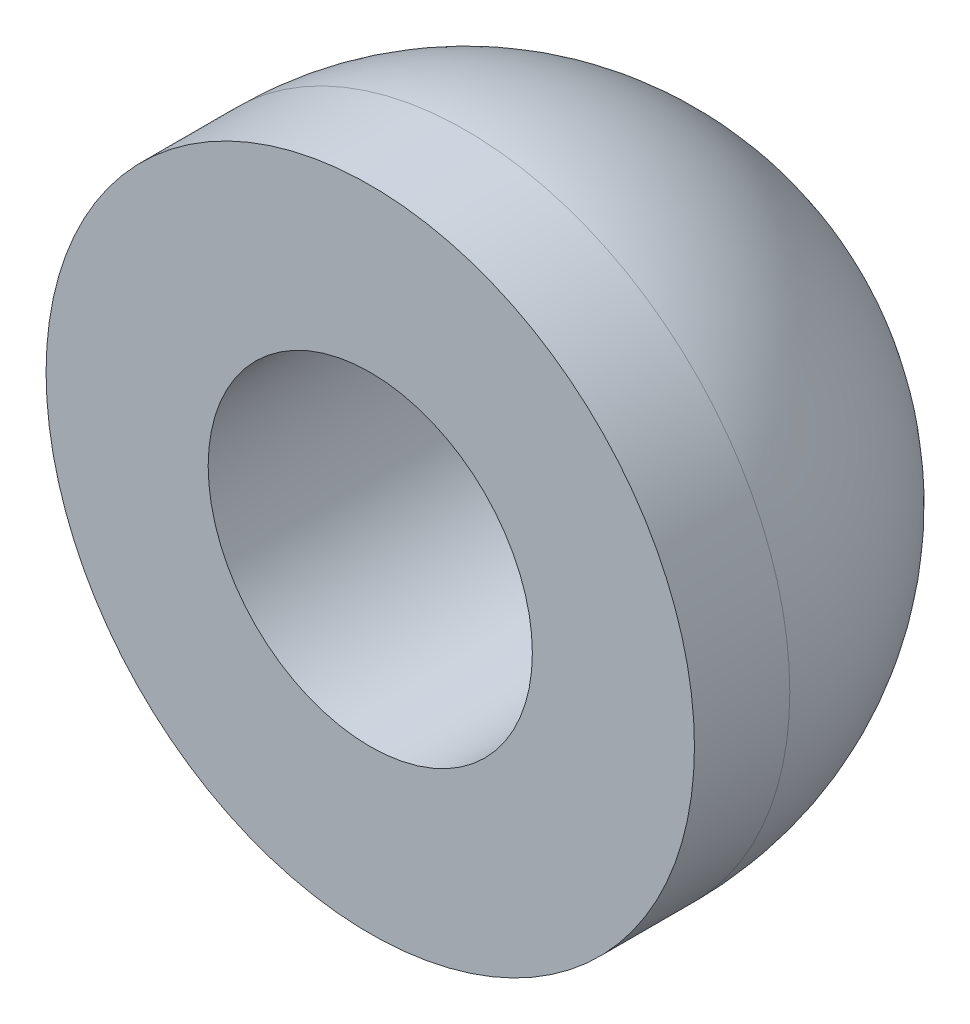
from build123d import *

# Parameters (mm, degrees)
ESQUISSE2_R             = 5.114927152
ENL_V_MAT_EXTRU_1_DEPTH = 1


with BuildPart() as part:
    # Esquisse1 → R_volution1 (revolve)
    with BuildSketch(Plane(origin=(0, 0, 0), x_dir=(0, 0, -1), z_dir=(1, 0, 0)), mode=Mode.PRIVATE) as r_volution1_sk:
        with BuildLine():
            Line((0, 4.25), (9.861215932, 4.25))
            ThreePointArc((9.861215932, 4.25), (6.75, 7.361215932), (2.5, 8.5))
            Line((2.5, 8.5), (0, 8.5))
            Line((0, 8.5), (0, 4.25))
        make_face()
    revolve(r_volution1_sk.sketch.rotate(Axis((0, 0, 0), (0, 0, -1)), 90), axis=Axis((0, 0, 0), (0, 0, -1)))

    # Esquisse2 → Enl_v. mat.-Extru.1 (cut)
    with BuildSketch(Plane.XY.offset(-9.75)):
        Circle(ESQUISSE2_R)
    extrude(amount=-ENL_V_MAT_EXTRU_1_DEPTH, mode=Mode.SUBTRACT)


solid = part.part
